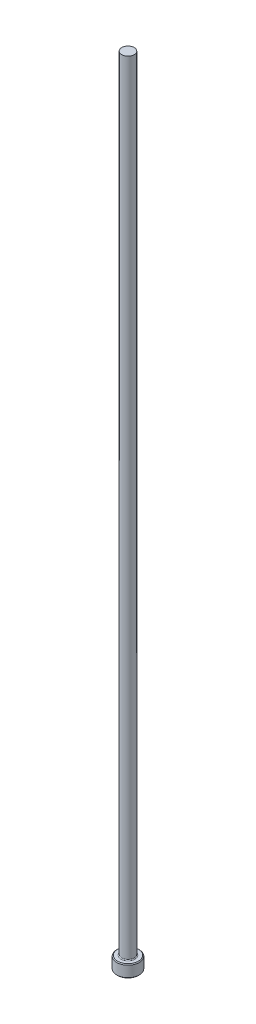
from build123d import *

# Parameters (mm, degrees)
CHAMFER1_SIZE = 0.254
FILLET1_R     = 0.254


with BuildPart() as part:
    # Sketch1 → Revolve1 (revolve)
    with BuildSketch(Plane.XY, mode=Mode.PRIVATE) as revolve1_sk:
        Polygon((0, 0), (-3.5687, 0), (-3.5687, 3.9624), (-1.98374, 3.9624), (-1.98374, 254), (0, 254), align=None)
    revolve(revolve1_sk.sketch.rotate(Axis((0, 259.958771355, 0), (0, -1, 0)), 270), axis=Axis((0, 259.958771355, 0), (0, -1, 0)))

    # Chamfer1
    chamfer1_edges = [part.edges().sort_by_distance(p)[0] for p in [
        (0, 3.9624, -3.5687),
        (0, 0, -3.5687),
    ]]
    chamfer(chamfer1_edges, length=CHAMFER1_SIZE)

    # Fillet1
    fillet1_edges = [part.edges().sort_by_distance(p)[0] for p in [
        (0, 3.9624, -1.98374),
    ]]
    fillet(fillet1_edges, radius=FILLET1_R)


solid = part.part
